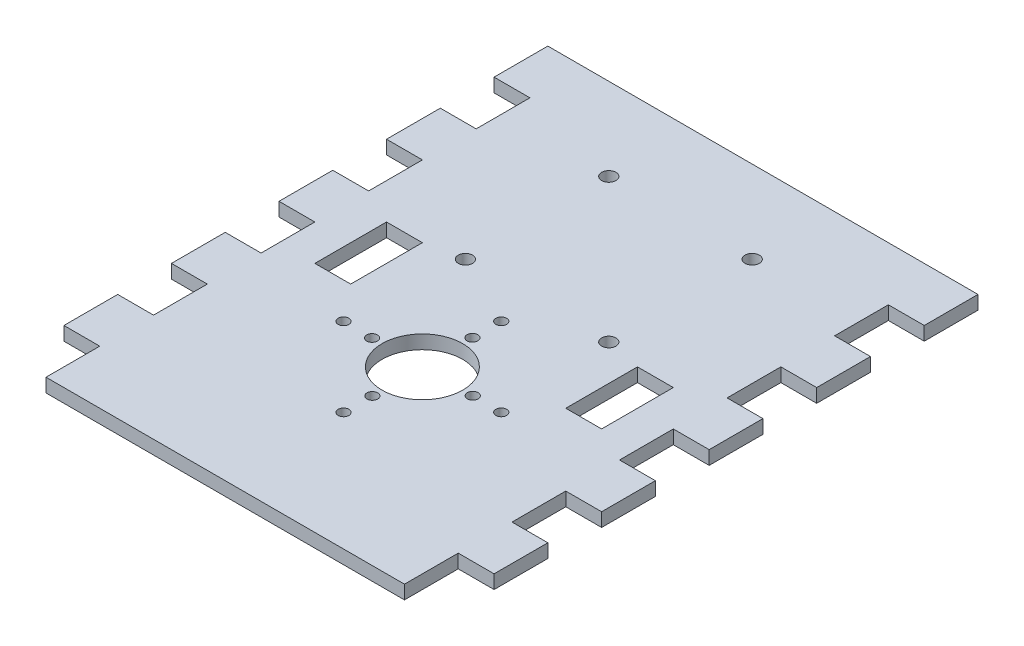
from build123d import *

# Parameters (mm, degrees)
PANELFACE_W   = 100
PANELFACE_H   = 150
PANELFACE_R   = 11.25
PANELFACE_R_2 = 1.5
PANELFACE_R_3 = 2
PANELFACE_W_2 = 10
PANELFACE_H_2 = 20
PANELX_DEPTH  = 3.81
TABS_W        = 10
TABS_H        = 15
TABSX_DEPTH   = 3.81


with BuildPart() as part:
    # panelface → panelx (new body)
    with BuildSketch(Plane(origin=(0, 0, 0), x_dir=(1, 0, 0), z_dir=(0, 1, 0))):
        with Locations((50, 75)):
            Rectangle(PANELFACE_W, PANELFACE_H)
        with Locations(Location((50, 55, 0), (0, 0, 270))):
            Circle(PANELFACE_R, mode=Mode.SUBTRACT)
        with Locations(Location((49.959811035, 68.999942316, 0), (0, 0, 270))):
            Circle(PANELFACE_R_2, mode=Mode.SUBTRACT)
        with Locations(Location((63.999942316, 55.040188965, 0), (0, 0, 270))):
            Circle(PANELFACE_R_2, mode=Mode.SUBTRACT)
        with Locations(Location((50.040188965, 41.000057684, 0), (0, 0, 270))):
            Circle(PANELFACE_R_2, mode=Mode.SUBTRACT)
        with Locations(Location((36.000057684, 54.959811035, 0), (0, 0, 270))):
            Circle(PANELFACE_R_2, mode=Mode.SUBTRACT)
        with Locations(Location((50, 33, 0), (0, 0, 270))):
            Circle(PANELFACE_R_2, mode=Mode.SUBTRACT)
        with Locations(Location((28, 55, 0), (0, 0, 270))):
            Circle(PANELFACE_R_2, mode=Mode.SUBTRACT)
        with Locations(Location((50, 77, 0), (0, 0, 270))):
            Circle(PANELFACE_R_2, mode=Mode.SUBTRACT)
        with Locations(Location((72, 55, 0), (0, 0, 270))):
            Circle(PANELFACE_R_2, mode=Mode.SUBTRACT)
        with Locations(Location((30, 127, 0), (0, 0, 270))):
            Circle(PANELFACE_R_3, mode=Mode.SUBTRACT)
        with Locations(Location((70, 127, 0), (0, 0, 270))):
            Circle(PANELFACE_R_3, mode=Mode.SUBTRACT)
        with Locations(Location((70, 87, 0), (0, 0, 270))):
            Circle(PANELFACE_R_3, mode=Mode.SUBTRACT)
        with Locations(Location((30, 87, 0), (0, 0, 270))):
            Circle(PANELFACE_R_3, mode=Mode.SUBTRACT)
        with Locations((15, 75)):
            Rectangle(PANELFACE_W_2, PANELFACE_H_2, mode=Mode.SUBTRACT)
        with Locations((85, 75)):
            Rectangle(PANELFACE_W_2, PANELFACE_H_2, mode=Mode.SUBTRACT)
    extrude(amount=PANELX_DEPTH)

    # tabs → tabsx (add)
    with BuildSketch(Plane.XZ):
        with Locations((105, -142.5)):
            Rectangle(TABS_W, TABS_H)
        with Locations((-5, -142.5)):
            Rectangle(TABS_W, TABS_H)
        with Locations((105, -112.5)):
            Rectangle(TABS_W, TABS_H)
        with Locations((-5, -112.5)):
            Rectangle(TABS_W, TABS_H)
        with Locations((105, -82.5)):
            Rectangle(TABS_W, TABS_H)
        with Locations((-5, -82.5)):
            Rectangle(TABS_W, TABS_H)
        with Locations((105, -52.5)):
            Rectangle(TABS_W, TABS_H)
        with Locations((-5, -52.5)):
            Rectangle(TABS_W, TABS_H)
        with Locations((105, -22.5)):
            Rectangle(TABS_W, TABS_H)
        with Locations((-5, -22.5)):
            Rectangle(TABS_W, TABS_H)
    extrude(amount=-TABSX_DEPTH)


solid = part.part
